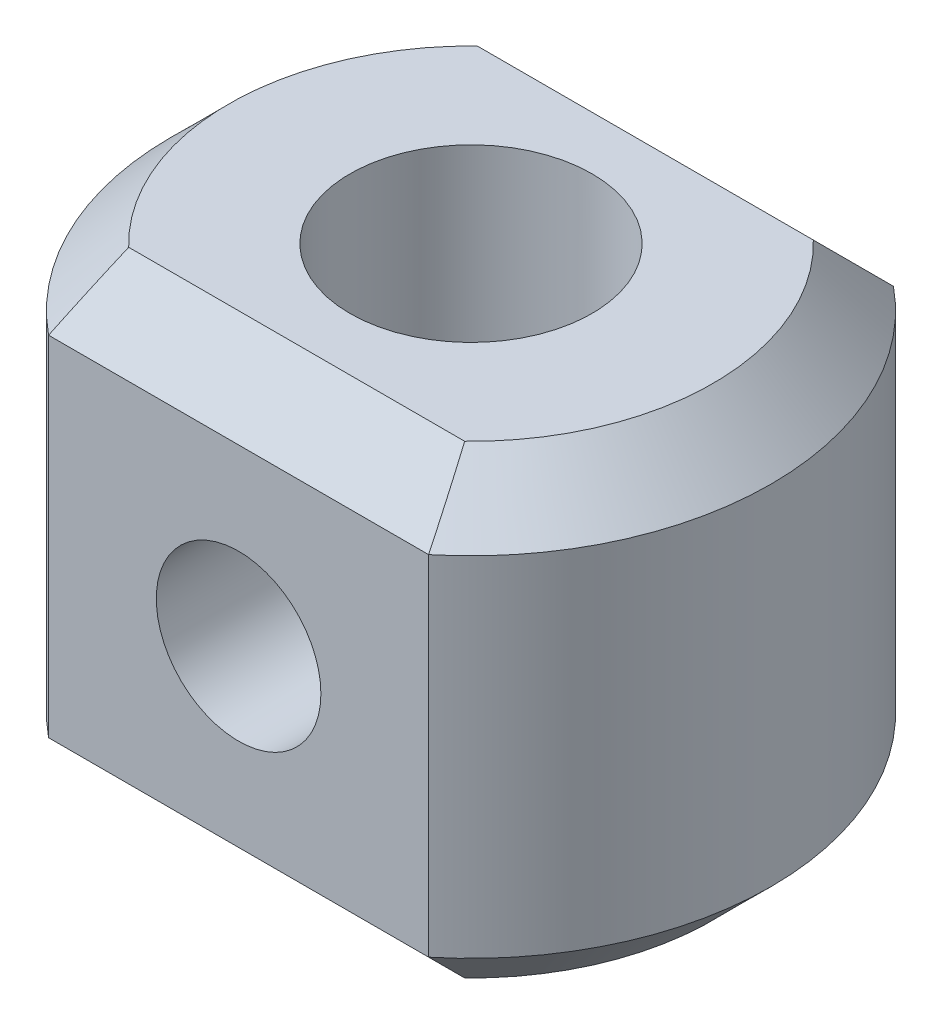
ISO-10303-21;
HEADER;
FILE_DESCRIPTION(('STEP AP214'),'2;1');
FILE_NAME('part.step','',(''),(''),'','','');
FILE_SCHEMA(('AUTOMOTIVE_DESIGN { 1 0 10303 214 1 1 1 1 }'));
ENDSEC;
DATA;
#1=APPLICATION_CONTEXT('core data for automotive mechanical design processes');
#2=APPLICATION_PROTOCOL_DEFINITION('international standard','automotive_design',2000,#1);
#3=PRODUCT_CONTEXT('',#1,'mechanical');
#4=PRODUCT('Part','Part','',(#3));
#5=PRODUCT_RELATED_PRODUCT_CATEGORY('part','',(#4));
#6=PRODUCT_DEFINITION_FORMATION('','',#4);
#7=PRODUCT_DEFINITION_CONTEXT('part definition',#1,'design');
#8=PRODUCT_DEFINITION('design','',#6,#7);
#9=PRODUCT_DEFINITION_SHAPE('','',#8);
#10=(LENGTH_UNIT() NAMED_UNIT(*) SI_UNIT(.MILLI.,.METRE.));
#11=(NAMED_UNIT(*) PLANE_ANGLE_UNIT() SI_UNIT($,.RADIAN.));
#12=(NAMED_UNIT(*) SI_UNIT($,.STERADIAN.) SOLID_ANGLE_UNIT());
#13=UNCERTAINTY_MEASURE_WITH_UNIT(LENGTH_MEASURE(1.E-05),#10,'distance_accuracy_value','');
#14=(GEOMETRIC_REPRESENTATION_CONTEXT(3) GLOBAL_UNCERTAINTY_ASSIGNED_CONTEXT((#13)) GLOBAL_UNIT_ASSIGNED_CONTEXT((#10,
#11,#12)) REPRESENTATION_CONTEXT('',''));
#15=CARTESIAN_POINT('',(0.,0.,0.));
#16=DIRECTION('',(0.,0.,1.));
#17=DIRECTION('',(1.,0.,0.));
#18=AXIS2_PLACEMENT_3D('',#15,#16,#17);
#19=CARTESIAN_POINT('',(0.,24.0000000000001,0.));
#20=DIRECTION('',(0.,1.,0.));
#21=DIRECTION('',(0.,0.,1.));
#22=AXIS2_PLACEMENT_3D('',#19,#20,#21);
#23=PLANE('',#22);
#24=CARTESIAN_POINT('',(0.,24.0000000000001,0.));
#25=DIRECTION('',(0.,1.,0.));
#26=DIRECTION('',(0.,0.,1.));
#27=AXIS2_PLACEMENT_3D('',#24,#25,#26);
#28=CIRCLE('',#27,12.5);
#29=CARTESIAN_POINT('',(0.,24.0000000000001,12.5));
#30=VERTEX_POINT('',#29);
#31=EDGE_CURVE('E438',#30,#30,#28,.T.);
#32=ORIENTED_EDGE('',*,*,#31,.F.);
#33=EDGE_LOOP('',(#32));
#34=FACE_BOUND('',#33,.T.);
#35=CARTESIAN_POINT('',(0.,24.0000000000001,0.));
#36=DIRECTION('',(0.,1.,0.));
#37=DIRECTION('',(0.,0.,1.));
#38=AXIS2_PLACEMENT_3D('',#35,#36,#37);
#39=CIRCLE('',#38,25.);
#40=CARTESIAN_POINT('',(17.3493515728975,24.0000000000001,18.));
#41=VERTEX_POINT('',#40);
#42=CARTESIAN_POINT('',(17.3493515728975,24.0000000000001,-18.));
#43=VERTEX_POINT('',#42);
#44=EDGE_CURVE('E31',#41,#43,#39,.T.);
#45=ORIENTED_EDGE('',*,*,#44,.T.);
#46=DIRECTION('',(-1.,0.,0.));
#47=VECTOR('',#46,1.);
#48=CARTESIAN_POINT('',(-19.6214168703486,24.,-18.));
#49=LINE('',#48,#47);
#50=CARTESIAN_POINT('',(-17.3493515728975,24.,-18.));
#51=VERTEX_POINT('',#50);
#52=EDGE_CURVE('E10',#43,#51,#49,.T.);
#53=ORIENTED_EDGE('',*,*,#52,.T.);
#54=CARTESIAN_POINT('',(0.,24.0000000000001,0.));
#55=DIRECTION('',(0.,1.,0.));
#56=DIRECTION('',(0.,0.,1.));
#57=AXIS2_PLACEMENT_3D('',#54,#55,#56);
#58=CIRCLE('',#57,25.);
#59=CARTESIAN_POINT('',(-17.3493515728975,24.,18.));
#60=VERTEX_POINT('',#59);
#61=EDGE_CURVE('E179',#51,#60,#58,.T.);
#62=ORIENTED_EDGE('',*,*,#61,.T.);
#63=DIRECTION('',(1.,0.,0.));
#64=VECTOR('',#63,1.);
#65=CARTESIAN_POINT('',(19.6214168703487,24.0000000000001,18.));
#66=LINE('',#65,#64);
#67=EDGE_CURVE('E49',#60,#41,#66,.T.);
#68=ORIENTED_EDGE('',*,*,#67,.T.);
#69=EDGE_LOOP('',(#45,#53,#62,#68));
#70=FACE_BOUND('',#69,.T.);
#71=ADVANCED_FACE('F16',(#34,#70),#23,.T.);
#72=CARTESIAN_POINT('',(0.,-24.,0.));
#73=DIRECTION('',(0.,1.,0.));
#74=DIRECTION('',(0.,0.,1.));
#75=AXIS2_PLACEMENT_3D('',#72,#73,#74);
#76=PLANE('',#75);
#77=CARTESIAN_POINT('',(0.,-24.,0.));
#78=DIRECTION('',(0.,1.,0.));
#79=DIRECTION('',(0.,0.,1.));
#80=AXIS2_PLACEMENT_3D('',#77,#78,#79);
#81=CIRCLE('',#80,12.5);
#82=CARTESIAN_POINT('',(0.,-24.,12.5));
#83=VERTEX_POINT('',#82);
#84=EDGE_CURVE('E431',#83,#83,#81,.T.);
#85=ORIENTED_EDGE('',*,*,#84,.T.);
#86=EDGE_LOOP('',(#85));
#87=FACE_BOUND('',#86,.T.);
#88=DIRECTION('',(-1.,0.,0.));
#89=VECTOR('',#88,1.);
#90=CARTESIAN_POINT('',(0.,-24.,18.));
#91=LINE('',#90,#89);
#92=CARTESIAN_POINT('',(17.3493515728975,-24.0000000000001,18.));
#93=VERTEX_POINT('',#92);
#94=CARTESIAN_POINT('',(-17.3493515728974,-24.,18.));
#95=VERTEX_POINT('',#94);
#96=EDGE_CURVE('E149',#93,#95,#91,.T.);
#97=ORIENTED_EDGE('',*,*,#96,.T.);
#98=CARTESIAN_POINT('',(0.,-24.,0.));
#99=DIRECTION('',(0.,1.,0.));
#100=DIRECTION('',(0.,0.,1.));
#101=AXIS2_PLACEMENT_3D('',#98,#99,#100);
#102=CIRCLE('',#101,25.);
#103=CARTESIAN_POINT('',(-17.3493515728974,-24.,-18.));
#104=VERTEX_POINT('',#103);
#105=EDGE_CURVE('E161',#95,#104,#102,.F.);
#106=ORIENTED_EDGE('',*,*,#105,.T.);
#107=DIRECTION('',(1.,0.,0.));
#108=VECTOR('',#107,1.);
#109=CARTESIAN_POINT('',(0.,-24.,-18.));
#110=LINE('',#109,#108);
#111=CARTESIAN_POINT('',(17.3493515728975,-24.0000000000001,-18.));
#112=VERTEX_POINT('',#111);
#113=EDGE_CURVE('E158',#104,#112,#110,.T.);
#114=ORIENTED_EDGE('',*,*,#113,.T.);
#115=CARTESIAN_POINT('',(0.,-24.,0.));
#116=DIRECTION('',(0.,1.,0.));
#117=DIRECTION('',(0.,0.,1.));
#118=AXIS2_PLACEMENT_3D('',#115,#116,#117);
#119=CIRCLE('',#118,25.);
#120=EDGE_CURVE('E155',#112,#93,#119,.F.);
#121=ORIENTED_EDGE('',*,*,#120,.T.);
#122=EDGE_LOOP('',(#97,#106,#114,#121));
#123=FACE_BOUND('',#122,.T.);
#124=ADVANCED_FACE('F264',(#87,#123),#76,.F.);
#125=CARTESIAN_POINT('',(0.,24.0000000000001,0.));
#126=DIRECTION('',(0.,-1.,0.));
#127=DIRECTION('',(0.,0.,-1.));
#128=AXIS2_PLACEMENT_3D('',#125,#126,#127);
#129=CYLINDRICAL_SURFACE('',#128,31.);
#130=DIRECTION('',(0.,-1.,0.));
#131=VECTOR('',#130,1.);
#132=CARTESIAN_POINT('',(-19.6214168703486,24.,-24.0000000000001));
#133=LINE('',#132,#131);
#134=CARTESIAN_POINT('',(-19.6214168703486,18.0000000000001,-24.0000000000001));
#135=VERTEX_POINT('',#134);
#136=CARTESIAN_POINT('',(-19.6214168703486,-18.,-24.0000000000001));
#137=VERTEX_POINT('',#136);
#138=EDGE_CURVE('E228',#135,#137,#133,.T.);
#139=ORIENTED_EDGE('',*,*,#138,.T.);
#140=CARTESIAN_POINT('',(0.,-18.,0.));
#141=DIRECTION('',(0.,1.,0.));
#142=DIRECTION('',(0.,0.,1.));
#143=AXIS2_PLACEMENT_3D('',#140,#141,#142);
#144=CIRCLE('',#143,31.);
#145=CARTESIAN_POINT('',(-19.6214168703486,-18.,24.0000000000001));
#146=VERTEX_POINT('',#145);
#147=EDGE_CURVE('E131',#137,#146,#144,.T.);
#148=ORIENTED_EDGE('',*,*,#147,.T.);
#149=DIRECTION('',(0.,-1.,0.));
#150=VECTOR('',#149,1.);
#151=CARTESIAN_POINT('',(-19.6214168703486,24.,24.0000000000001));
#152=LINE('',#151,#150);
#153=CARTESIAN_POINT('',(-19.6214168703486,18.0000000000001,24.0000000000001));
#154=VERTEX_POINT('',#153);
#155=EDGE_CURVE('E113',#154,#146,#152,.T.);
#156=ORIENTED_EDGE('',*,*,#155,.F.);
#157=CARTESIAN_POINT('',(0.,18.,0.));
#158=DIRECTION('',(0.,1.,0.));
#159=DIRECTION('',(0.,0.,1.));
#160=AXIS2_PLACEMENT_3D('',#157,#158,#159);
#161=CIRCLE('',#160,31.);
#162=EDGE_CURVE('E128',#154,#135,#161,.F.);
#163=ORIENTED_EDGE('',*,*,#162,.T.);
#164=EDGE_LOOP('',(#139,#148,#156,#163));
#165=FACE_BOUND('',#164,.T.);
#166=ADVANCED_FACE('F126',(#165),#129,.T.);
#167=CARTESIAN_POINT('',(-19.6214168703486,24.,24.0000000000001));
#168=DIRECTION('',(0.,0.,-1.));
#169=DIRECTION('',(-1.,0.,0.));
#170=AXIS2_PLACEMENT_3D('',#167,#168,#169);
#171=PLANE('',#170);
#172=CARTESIAN_POINT('',(0.,0.,24.0000000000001));
#173=DIRECTION('',(0.,0.,1.));
#174=DIRECTION('',(1.,0.,0.));
#175=AXIS2_PLACEMENT_3D('',#172,#173,#174);
#176=CIRCLE('',#175,8.50000000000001);
#177=CARTESIAN_POINT('',(8.50000000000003,0.,24.0000000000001));
#178=VERTEX_POINT('',#177);
#179=EDGE_CURVE('E456',#178,#178,#176,.T.);
#180=ORIENTED_EDGE('',*,*,#179,.F.);
#181=EDGE_LOOP('',(#180));
#182=FACE_BOUND('',#181,.T.);
#183=ORIENTED_EDGE('',*,*,#155,.T.);
#184=DIRECTION('',(1.,0.,0.));
#185=VECTOR('',#184,1.);
#186=CARTESIAN_POINT('',(-19.6214168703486,-18.,24.0000000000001));
#187=LINE('',#186,#185);
#188=CARTESIAN_POINT('',(19.6214168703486,-18.,24.0000000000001));
#189=VERTEX_POINT('',#188);
#190=EDGE_CURVE('E120',#146,#189,#187,.T.);
#191=ORIENTED_EDGE('',*,*,#190,.T.);
#192=DIRECTION('',(0.,-1.,0.));
#193=VECTOR('',#192,1.);
#194=CARTESIAN_POINT('',(19.6214168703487,24.0000000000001,24.0000000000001));
#195=LINE('',#194,#193);
#196=CARTESIAN_POINT('',(19.6214168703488,18.0000000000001,24.0000000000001));
#197=VERTEX_POINT('',#196);
#198=EDGE_CURVE('E115',#197,#189,#195,.T.);
#199=ORIENTED_EDGE('',*,*,#198,.F.);
#200=DIRECTION('',(-1.,0.,0.));
#201=VECTOR('',#200,1.);
#202=CARTESIAN_POINT('',(-19.6214168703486,18.0000000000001,24.0000000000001));
#203=LINE('',#202,#201);
#204=EDGE_CURVE('E110',#197,#154,#203,.T.);
#205=ORIENTED_EDGE('',*,*,#204,.T.);
#206=EDGE_LOOP('',(#183,#191,#199,#205));
#207=FACE_BOUND('',#206,.T.);
#208=ADVANCED_FACE('F112',(#182,#207),#171,.F.);
#209=CARTESIAN_POINT('',(0.,24.0000000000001,0.));
#210=DIRECTION('',(0.,-1.,0.));
#211=DIRECTION('',(0.,0.,-1.));
#212=AXIS2_PLACEMENT_3D('',#209,#210,#211);
#213=CYLINDRICAL_SURFACE('',#212,31.);
#214=ORIENTED_EDGE('',*,*,#198,.T.);
#215=CARTESIAN_POINT('',(0.,-18.,0.));
#216=DIRECTION('',(0.,1.,0.));
#217=DIRECTION('',(0.,0.,1.));
#218=AXIS2_PLACEMENT_3D('',#215,#216,#217);
#219=CIRCLE('',#218,31.);
#220=CARTESIAN_POINT('',(19.6214168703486,-18.,-24.0000000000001));
#221=VERTEX_POINT('',#220);
#222=EDGE_CURVE('E121',#189,#221,#219,.T.);
#223=ORIENTED_EDGE('',*,*,#222,.T.);
#224=DIRECTION('',(0.,-1.,0.));
#225=VECTOR('',#224,1.);
#226=CARTESIAN_POINT('',(19.6214168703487,24.0000000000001,-24.0000000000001));
#227=LINE('',#226,#225);
#228=CARTESIAN_POINT('',(19.6214168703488,18.0000000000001,-24.0000000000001));
#229=VERTEX_POINT('',#228);
#230=EDGE_CURVE('E509',#229,#221,#227,.T.);
#231=ORIENTED_EDGE('',*,*,#230,.F.);
#232=CARTESIAN_POINT('',(0.,18.,0.));
#233=DIRECTION('',(0.,1.,0.));
#234=DIRECTION('',(0.,0.,1.));
#235=AXIS2_PLACEMENT_3D('',#232,#233,#234);
#236=CIRCLE('',#235,31.);
#237=EDGE_CURVE('E172',#229,#197,#236,.F.);
#238=ORIENTED_EDGE('',*,*,#237,.T.);
#239=EDGE_LOOP('',(#214,#223,#231,#238));
#240=FACE_BOUND('',#239,.T.);
#241=ADVANCED_FACE('F281',(#240),#213,.T.);
#242=CARTESIAN_POINT('',(-19.6214168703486,24.,-24.0000000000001));
#243=DIRECTION('',(0.,0.,1.));
#244=DIRECTION('',(1.,0.,0.));
#245=AXIS2_PLACEMENT_3D('',#242,#243,#244);
#246=PLANE('',#245);
#247=CARTESIAN_POINT('',(0.,0.,-24.0000000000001));
#248=DIRECTION('',(0.,0.,1.));
#249=DIRECTION('',(1.,0.,0.));
#250=AXIS2_PLACEMENT_3D('',#247,#248,#249);
#251=CIRCLE('',#250,8.50000000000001);
#252=CARTESIAN_POINT('',(8.50000000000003,0.,-24.0000000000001));
#253=VERTEX_POINT('',#252);
#254=EDGE_CURVE('E437',#253,#253,#251,.T.);
#255=ORIENTED_EDGE('',*,*,#254,.T.);
#256=EDGE_LOOP('',(#255));
#257=FACE_BOUND('',#256,.T.);
#258=ORIENTED_EDGE('',*,*,#230,.T.);
#259=DIRECTION('',(-1.,0.,0.));
#260=VECTOR('',#259,1.);
#261=CARTESIAN_POINT('',(-19.6214168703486,-18.,-24.0000000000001));
#262=LINE('',#261,#260);
#263=EDGE_CURVE('E169',#221,#137,#262,.T.);
#264=ORIENTED_EDGE('',*,*,#263,.T.);
#265=ORIENTED_EDGE('',*,*,#138,.F.);
#266=DIRECTION('',(1.,0.,0.));
#267=VECTOR('',#266,1.);
#268=CARTESIAN_POINT('',(19.6214168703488,18.0000000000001,-24.0000000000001));
#269=LINE('',#268,#267);
#270=EDGE_CURVE('E165',#135,#229,#269,.T.);
#271=ORIENTED_EDGE('',*,*,#270,.T.);
#272=EDGE_LOOP('',(#258,#264,#265,#271));
#273=FACE_BOUND('',#272,.T.);
#274=ADVANCED_FACE('F278',(#257,#273),#246,.F.);
#275=CARTESIAN_POINT('',(0.,-18.,0.));
#276=DIRECTION('',(0.,1.,0.));
#277=DIRECTION('',(0.,0.,1.));
#278=AXIS2_PLACEMENT_3D('',#275,#276,#277);
#279=CONICAL_SURFACE('',#278,31.,0.785398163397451);
#280=CARTESIAN_POINT('',(17.3493515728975,-24.0000000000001,18.));
#281=CARTESIAN_POINT('',(17.5501842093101,-23.502203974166,18.4977960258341));
#282=CARTESIAN_POINT('',(17.7478180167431,-23.0037662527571,18.996233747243));
#283=CARTESIAN_POINT('',(18.1371787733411,-22.0057696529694,19.9942303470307));
#284=CARTESIAN_POINT('',(18.328906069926,-21.5062108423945,20.4937891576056));
#285=CARTESIAN_POINT('',(18.7069652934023,-20.5060831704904,21.4939168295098));
#286=CARTESIAN_POINT('',(18.8932973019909,-20.0055143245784,21.9944856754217));
#287=CARTESIAN_POINT('',(19.2609880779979,-19.0034323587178,22.9965676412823));
#288=CARTESIAN_POINT('',(19.4423465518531,-18.5019191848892,23.4980808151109));
#289=CARTESIAN_POINT('',(19.6214168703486,-18.,24.0000000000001));
#290=B_SPLINE_CURVE_WITH_KNOTS('',3,(#280,#281,#282,#283,#284,#285,#286,#287,#288,#289),
.UNSPECIFIED.,.F.,.F.,(4,2,2,2,4),(0.,2.19621393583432,4.39229844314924,6.58834967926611,
8.78453025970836),.UNSPECIFIED.);
#291=EDGE_CURVE('E229',#93,#189,#290,.T.);
#292=ORIENTED_EDGE('',*,*,#291,.F.);
#293=ORIENTED_EDGE('',*,*,#120,.F.);
#294=CARTESIAN_POINT('',(17.3493515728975,-24.0000000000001,-18.));
#295=CARTESIAN_POINT('',(17.5501842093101,-23.502203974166,-18.4977960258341));
#296=CARTESIAN_POINT('',(17.7478180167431,-23.0037662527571,-18.996233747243));
#297=CARTESIAN_POINT('',(18.1371787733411,-22.0057696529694,-19.9942303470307));
#298=CARTESIAN_POINT('',(18.328906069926,-21.5062108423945,-20.4937891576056));
#299=CARTESIAN_POINT('',(18.7069652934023,-20.5060831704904,-21.4939168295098));
#300=CARTESIAN_POINT('',(18.8932973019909,-20.0055143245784,-21.9944856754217));
#301=CARTESIAN_POINT('',(19.2609880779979,-19.0034323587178,-22.9965676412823));
#302=CARTESIAN_POINT('',(19.4423465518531,-18.5019191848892,-23.4980808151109));
#303=CARTESIAN_POINT('',(19.6214168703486,-18.,-24.0000000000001));
#304=B_SPLINE_CURVE_WITH_KNOTS('',3,(#294,#295,#296,#297,#298,#299,#300,#301,#302,#303),
.UNSPECIFIED.,.F.,.F.,(4,2,2,2,4),(0.,2.19621393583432,4.39229844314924,6.58834967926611,
8.78453025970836),.UNSPECIFIED.);
#305=EDGE_CURVE('E220',#221,#112,#304,.F.);
#306=ORIENTED_EDGE('',*,*,#305,.F.);
#307=ORIENTED_EDGE('',*,*,#222,.F.);
#308=EDGE_LOOP('',(#292,#293,#306,#307));
#309=FACE_BOUND('',#308,.T.);
#310=ADVANCED_FACE('F214',(#309),#279,.T.);
#311=CARTESIAN_POINT('',(-19.6214168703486,-18.,-24.0000000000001));
#312=DIRECTION('',(0.,0.707106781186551,0.707106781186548));
#313=DIRECTION('',(-1.,0.,0.));
#314=AXIS2_PLACEMENT_3D('',#311,#312,#313);
#315=PLANE('',#314);
#316=ORIENTED_EDGE('',*,*,#305,.T.);
#317=ORIENTED_EDGE('',*,*,#113,.F.);
#318=CARTESIAN_POINT('',(-17.3493515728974,-24.,-18.));
#319=CARTESIAN_POINT('',(-17.55018420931,-23.502203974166,-18.4977960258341));
#320=CARTESIAN_POINT('',(-17.7478180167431,-23.0037662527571,-18.996233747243));
#321=CARTESIAN_POINT('',(-18.1371787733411,-22.0057696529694,-19.9942303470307));
#322=CARTESIAN_POINT('',(-18.328906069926,-21.5062108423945,-20.4937891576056));
#323=CARTESIAN_POINT('',(-18.7069652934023,-20.5060831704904,-21.4939168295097));
#324=CARTESIAN_POINT('',(-18.8932973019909,-20.0055143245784,-21.9944856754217));
#325=CARTESIAN_POINT('',(-19.2609880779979,-19.0034323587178,-22.9965676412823));
#326=CARTESIAN_POINT('',(-19.4423465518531,-18.5019191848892,-23.4980808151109));
#327=CARTESIAN_POINT('',(-19.6214168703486,-18.,-24.0000000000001));
#328=B_SPLINE_CURVE_WITH_KNOTS('',3,(#318,#319,#320,#321,#322,#323,#324,#325,#326,#327),
.UNSPECIFIED.,.F.,.F.,(4,2,2,2,4),(0.,2.19621393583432,4.39229844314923,6.5883496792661,
8.78453025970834),.UNSPECIFIED.);
#329=EDGE_CURVE('E195',#137,#104,#328,.F.);
#330=ORIENTED_EDGE('',*,*,#329,.F.);
#331=ORIENTED_EDGE('',*,*,#263,.F.);
#332=EDGE_LOOP('',(#316,#317,#330,#331));
#333=FACE_BOUND('',#332,.T.);
#334=ADVANCED_FACE('F209',(#333),#315,.F.);
#335=CARTESIAN_POINT('',(-19.6214168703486,-18.,24.0000000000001));
#336=DIRECTION('',(0.,0.707106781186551,-0.707106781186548));
#337=DIRECTION('',(1.,0.,0.));
#338=AXIS2_PLACEMENT_3D('',#335,#336,#337);
#339=PLANE('',#338);
#340=ORIENTED_EDGE('',*,*,#291,.T.);
#341=ORIENTED_EDGE('',*,*,#190,.F.);
#342=CARTESIAN_POINT('',(-19.6214168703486,-18.,24.0000000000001));
#343=CARTESIAN_POINT('',(-19.4423465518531,-18.5019191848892,23.4980808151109));
#344=CARTESIAN_POINT('',(-19.2609880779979,-19.0034323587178,22.9965676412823));
#345=CARTESIAN_POINT('',(-18.8932973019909,-20.0055143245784,21.9944856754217));
#346=CARTESIAN_POINT('',(-18.7069652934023,-20.5060831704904,21.4939168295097));
#347=CARTESIAN_POINT('',(-18.328906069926,-21.5062108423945,20.4937891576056));
#348=CARTESIAN_POINT('',(-18.1371787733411,-22.0057696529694,19.9942303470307));
#349=CARTESIAN_POINT('',(-17.7478180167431,-23.0037662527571,18.996233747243));
#350=CARTESIAN_POINT('',(-17.55018420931,-23.502203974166,18.4977960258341));
#351=CARTESIAN_POINT('',(-17.3493515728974,-24.0000000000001,18.));
#352=B_SPLINE_CURVE_WITH_KNOTS('',3,(#342,#343,#344,#345,#346,#347,#348,#349,#350,#351),
.UNSPECIFIED.,.F.,.F.,(4,2,2,2,4),(0.,2.19618058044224,4.3922318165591,6.58831632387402,
8.78453025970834),.UNSPECIFIED.);
#353=EDGE_CURVE('E186',#95,#146,#352,.F.);
#354=ORIENTED_EDGE('',*,*,#353,.F.);
#355=ORIENTED_EDGE('',*,*,#96,.F.);
#356=EDGE_LOOP('',(#340,#341,#354,#355));
#357=FACE_BOUND('',#356,.T.);
#358=ADVANCED_FACE('F202',(#357),#339,.F.);
#359=CARTESIAN_POINT('',(0.,-18.,0.));
#360=DIRECTION('',(0.,1.,0.));
#361=DIRECTION('',(0.,0.,1.));
#362=AXIS2_PLACEMENT_3D('',#359,#360,#361);
#363=CONICAL_SURFACE('',#362,31.,0.785398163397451);
#364=ORIENTED_EDGE('',*,*,#329,.T.);
#365=ORIENTED_EDGE('',*,*,#105,.F.);
#366=ORIENTED_EDGE('',*,*,#353,.T.);
#367=ORIENTED_EDGE('',*,*,#147,.F.);
#368=EDGE_LOOP('',(#364,#365,#366,#367));
#369=FACE_BOUND('',#368,.T.);
#370=ADVANCED_FACE('F205',(#369),#363,.T.);
#371=CARTESIAN_POINT('',(0.,24.0000000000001,18.));
#372=DIRECTION('',(0.,0.707106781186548,0.707106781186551));
#373=DIRECTION('',(-1.,0.,0.));
#374=AXIS2_PLACEMENT_3D('',#371,#372,#373);
#375=PLANE('',#374);
#376=CARTESIAN_POINT('',(-19.6214168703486,18.0000000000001,24.0000000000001));
#377=CARTESIAN_POINT('',(-19.4423465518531,18.5019191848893,23.4980808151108));
#378=CARTESIAN_POINT('',(-19.2609880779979,19.0034323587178,22.9965676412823));
#379=CARTESIAN_POINT('',(-18.893297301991,20.0055143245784,21.9944856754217));
#380=CARTESIAN_POINT('',(-18.7069652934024,20.5060831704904,21.4939168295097));
#381=CARTESIAN_POINT('',(-18.3289060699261,21.5062108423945,20.4937891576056));
#382=CARTESIAN_POINT('',(-18.1371787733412,22.0057696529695,19.9942303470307));
#383=CARTESIAN_POINT('',(-17.7478180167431,23.0037662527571,18.996233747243));
#384=CARTESIAN_POINT('',(-17.5501842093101,23.502203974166,18.4977960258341));
#385=CARTESIAN_POINT('',(-17.3493515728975,24.,18.0000000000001));
#386=B_SPLINE_CURVE_WITH_KNOTS('',3,(#376,#377,#378,#379,#380,#381,#382,#383,#384,#385),
.UNSPECIFIED.,.F.,.F.,(4,2,2,2,4),(0.,2.19618058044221,4.39223181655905,6.58831632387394,
8.78453025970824),.UNSPECIFIED.);
#387=EDGE_CURVE('E135',#154,#60,#386,.T.);
#388=ORIENTED_EDGE('',*,*,#387,.F.);
#389=ORIENTED_EDGE('',*,*,#204,.F.);
#390=CARTESIAN_POINT('',(19.6214168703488,18.0000000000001,24.0000000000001));
#391=CARTESIAN_POINT('',(19.4423465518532,18.5019191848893,23.4980808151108));
#392=CARTESIAN_POINT('',(19.2609880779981,19.0034323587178,22.9965676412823));
#393=CARTESIAN_POINT('',(18.8932973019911,20.0055143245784,21.9944856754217));
#394=CARTESIAN_POINT('',(18.7069652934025,20.5060831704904,21.4939168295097));
#395=CARTESIAN_POINT('',(18.3289060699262,21.5062108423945,20.4937891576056));
#396=CARTESIAN_POINT('',(18.1371787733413,22.0057696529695,19.9942303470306));
#397=CARTESIAN_POINT('',(17.7478180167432,23.0037662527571,18.996233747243));
#398=CARTESIAN_POINT('',(17.5501842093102,23.502203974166,18.4977960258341));
#399=CARTESIAN_POINT('',(17.3493515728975,24.0000000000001,18.0000000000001));
#400=B_SPLINE_CURVE_WITH_KNOTS('',3,(#390,#391,#392,#393,#394,#395,#396,#397,#398,#399),
.UNSPECIFIED.,.F.,.F.,(4,2,2,2,4),(0.,2.19618058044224,4.3922318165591,6.58831632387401,
8.78453025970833),.UNSPECIFIED.);
#401=EDGE_CURVE('E21',#41,#197,#400,.F.);
#402=ORIENTED_EDGE('',*,*,#401,.F.);
#403=ORIENTED_EDGE('',*,*,#67,.F.);
#404=EDGE_LOOP('',(#388,#389,#402,#403));
#405=FACE_BOUND('',#404,.T.);
#406=ADVANCED_FACE('F18',(#405),#375,.T.);
#407=CARTESIAN_POINT('',(0.,24.0000000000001,0.));
#408=DIRECTION('',(0.,-1.,0.));
#409=DIRECTION('',(0.,0.,-1.));
#410=AXIS2_PLACEMENT_3D('',#407,#408,#409);
#411=CONICAL_SURFACE('',#410,25.,0.785398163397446);
#412=ORIENTED_EDGE('',*,*,#401,.T.);
#413=ORIENTED_EDGE('',*,*,#237,.F.);
#414=CARTESIAN_POINT('',(19.6214168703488,18.0000000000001,-24.0000000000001));
#415=CARTESIAN_POINT('',(19.4423465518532,18.5019191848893,-23.4980808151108));
#416=CARTESIAN_POINT('',(19.2609880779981,19.0034323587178,-22.9965676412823));
#417=CARTESIAN_POINT('',(18.8932973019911,20.0055143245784,-21.9944856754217));
#418=CARTESIAN_POINT('',(18.7069652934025,20.5060831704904,-21.4939168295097));
#419=CARTESIAN_POINT('',(18.3289060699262,21.5062108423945,-20.4937891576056));
#420=CARTESIAN_POINT('',(18.1371787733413,22.0057696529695,-19.9942303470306));
#421=CARTESIAN_POINT('',(17.7478180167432,23.0037662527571,-18.996233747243));
#422=CARTESIAN_POINT('',(17.5501842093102,23.502203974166,-18.4977960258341));
#423=CARTESIAN_POINT('',(17.3493515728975,24.0000000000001,-18.0000000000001));
#424=B_SPLINE_CURVE_WITH_KNOTS('',3,(#414,#415,#416,#417,#418,#419,#420,#421,#422,#423),
.UNSPECIFIED.,.F.,.F.,(4,2,2,2,4),(0.,2.19618058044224,4.3922318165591,6.58831632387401,
8.78453025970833),.UNSPECIFIED.);
#425=EDGE_CURVE('E139',#43,#229,#424,.F.);
#426=ORIENTED_EDGE('',*,*,#425,.F.);
#427=ORIENTED_EDGE('',*,*,#44,.F.);
#428=EDGE_LOOP('',(#412,#413,#426,#427));
#429=FACE_BOUND('',#428,.T.);
#430=ADVANCED_FACE('F252',(#429),#411,.T.);
#431=CARTESIAN_POINT('',(0.,24.0000000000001,0.));
#432=DIRECTION('',(0.,-1.,0.));
#433=DIRECTION('',(0.,0.,-1.));
#434=AXIS2_PLACEMENT_3D('',#431,#432,#433);
#435=CONICAL_SURFACE('',#434,25.,0.785398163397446);
#436=ORIENTED_EDGE('',*,*,#387,.T.);
#437=ORIENTED_EDGE('',*,*,#61,.F.);
#438=CARTESIAN_POINT('',(-17.3493515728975,24.,-18.));
#439=CARTESIAN_POINT('',(-17.5501842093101,23.502203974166,-18.4977960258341));
#440=CARTESIAN_POINT('',(-17.7478180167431,23.0037662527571,-18.996233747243));
#441=CARTESIAN_POINT('',(-18.1371787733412,22.0057696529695,-19.9942303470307));
#442=CARTESIAN_POINT('',(-18.3289060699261,21.5062108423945,-20.4937891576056));
#443=CARTESIAN_POINT('',(-18.7069652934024,20.5060831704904,-21.4939168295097));
#444=CARTESIAN_POINT('',(-18.893297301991,20.0055143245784,-21.9944856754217));
#445=CARTESIAN_POINT('',(-19.2609880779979,19.0034323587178,-22.9965676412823));
#446=CARTESIAN_POINT('',(-19.4423465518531,18.5019191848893,-23.4980808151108));
#447=CARTESIAN_POINT('',(-19.6214168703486,18.0000000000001,-24.0000000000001));
#448=B_SPLINE_CURVE_WITH_KNOTS('',3,(#438,#439,#440,#441,#442,#443,#444,#445,#446,#447),
.UNSPECIFIED.,.F.,.F.,(4,2,2,2,4),(0.,2.19621393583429,4.39229844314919,6.58834967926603,
8.78453025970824),.UNSPECIFIED.);
#449=EDGE_CURVE('E142',#135,#51,#448,.F.);
#450=ORIENTED_EDGE('',*,*,#449,.F.);
#451=ORIENTED_EDGE('',*,*,#162,.F.);
#452=EDGE_LOOP('',(#436,#437,#450,#451));
#453=FACE_BOUND('',#452,.T.);
#454=ADVANCED_FACE('F141',(#453),#435,.T.);
#455=CARTESIAN_POINT('',(0.,24.0000000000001,-18.));
#456=DIRECTION('',(0.,0.707106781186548,-0.707106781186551));
#457=DIRECTION('',(1.,0.,0.));
#458=AXIS2_PLACEMENT_3D('',#455,#456,#457);
#459=PLANE('',#458);
#460=ORIENTED_EDGE('',*,*,#425,.T.);
#461=ORIENTED_EDGE('',*,*,#270,.F.);
#462=ORIENTED_EDGE('',*,*,#449,.T.);
#463=ORIENTED_EDGE('',*,*,#52,.F.);
#464=EDGE_LOOP('',(#460,#461,#462,#463));
#465=FACE_BOUND('',#464,.T.);
#466=ADVANCED_FACE('F247',(#465),#459,.T.);
#467=CARTESIAN_POINT('',(0.,0.,-24.0000000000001));
#468=DIRECTION('',(0.,0.,1.));
#469=DIRECTION('',(1.,0.,0.));
#470=AXIS2_PLACEMENT_3D('',#467,#468,#469);
#471=CYLINDRICAL_SURFACE('',#470,8.50000000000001);
#472=CARTESIAN_POINT('',(8.50000000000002,0.,9.1651513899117));
#473=CARTESIAN_POINT('',(8.49999848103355,-0.206088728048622,9.16515435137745));
#474=CARTESIAN_POINT('',(8.49248800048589,-0.412212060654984,9.17213583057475));
#475=CARTESIAN_POINT('',(8.4626153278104,-0.822482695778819,9.19970325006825));
#476=CARTESIAN_POINT('',(8.44024911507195,-1.02662944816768,9.22029287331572));
#477=CARTESIAN_POINT('',(8.38110344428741,-1.43143853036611,9.27408730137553));
#478=CARTESIAN_POINT('',(8.34430186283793,-1.63209501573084,9.30731146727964));
#479=CARTESIAN_POINT('',(8.25695470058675,-2.0282711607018,9.38488691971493));
#480=CARTESIAN_POINT('',(8.20640187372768,-2.22378805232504,9.42924407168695));
#481=CARTESIAN_POINT('',(8.09292937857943,-2.6065126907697,9.52680514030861));
#482=CARTESIAN_POINT('',(8.03014703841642,-2.79378671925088,9.57990988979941));
#483=CARTESIAN_POINT('',(7.89263199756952,-3.16147211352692,9.69352020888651));
#484=CARTESIAN_POINT('',(7.81790087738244,-3.34188438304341,9.75402479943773));
#485=CARTESIAN_POINT('',(7.57668843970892,-3.87228632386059,9.94412008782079));
#486=CARTESIAN_POINT('',(7.39312795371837,-4.21164033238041,10.0823463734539));
#487=CARTESIAN_POINT('',(7.07025089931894,-4.72346898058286,10.3093525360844));
#488=CARTESIAN_POINT('',(6.94452130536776,-4.90639680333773,10.3946444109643));
#489=CARTESIAN_POINT('',(6.67951741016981,-5.26147264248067,10.5668815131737));
#490=CARTESIAN_POINT('',(6.54024093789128,-5.43361892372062,10.6538270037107));
#491=CARTESIAN_POINT('',(6.24847211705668,-5.76677475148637,10.8275327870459));
#492=CARTESIAN_POINT('',(6.09596586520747,-5.92777225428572,10.9142927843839));
#493=CARTESIAN_POINT('',(5.7782479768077,-6.23787798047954,11.0857764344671));
#494=CARTESIAN_POINT('',(5.61303651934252,-6.38698637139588,11.1705001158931));
#495=CARTESIAN_POINT('',(5.24396777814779,-6.69455134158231,11.3489649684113));
#496=CARTESIAN_POINT('',(5.03807127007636,-6.85092906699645,11.4420938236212));
#497=CARTESIAN_POINT('',(4.61060952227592,-7.14560475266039,11.6209276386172));
#498=CARTESIAN_POINT('',(4.38904162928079,-7.28389964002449,11.7066313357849));
#499=CARTESIAN_POINT('',(3.93167037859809,-7.54059872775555,11.8680532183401));
#500=CARTESIAN_POINT('',(3.69588915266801,-7.65903281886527,11.9437863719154));
#501=CARTESIAN_POINT('',(3.21133572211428,-7.8744872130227,12.0830786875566));
#502=CARTESIAN_POINT('',(2.96256879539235,-7.97151613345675,12.1466427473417));
#503=CARTESIAN_POINT('',(2.51940835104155,-8.12048949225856,12.2450026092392));
#504=CARTESIAN_POINT('',(2.32744758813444,-8.17761353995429,12.2829947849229));
#505=CARTESIAN_POINT('',(1.93855933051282,-8.27842440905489,12.3503400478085));
#506=CARTESIAN_POINT('',(1.74163284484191,-8.32211393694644,12.3796948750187));
#507=CARTESIAN_POINT('',(1.34415899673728,-8.39547825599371,12.4291319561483));
#508=CARTESIAN_POINT('',(1.14361390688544,-8.42516154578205,12.4492198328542));
#509=CARTESIAN_POINT('',(0.740172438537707,-8.47014398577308,12.4797061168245));
#510=CARTESIAN_POINT('',(0.537275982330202,-8.4854426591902,12.4901042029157));
#511=CARTESIAN_POINT('',(0.130292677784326,-8.50144499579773,12.5009812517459));
#512=CARTESIAN_POINT('',(-0.0737956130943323,-8.50212364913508,12.5014432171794));
#513=CARTESIAN_POINT('',(-0.481268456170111,-8.48881228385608,12.4923941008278));
#514=CARTESIAN_POINT('',(-0.684653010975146,-8.47482231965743,12.4828830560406));
#515=CARTESIAN_POINT('',(-1.08925251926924,-8.43237316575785,12.4541027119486));
#516=CARTESIAN_POINT('',(-1.29046693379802,-8.40391046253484,12.4348310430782));
#517=CARTESIAN_POINT('',(-1.68926040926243,-8.33291196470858,12.3869582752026));
#518=CARTESIAN_POINT('',(-1.88683945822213,-8.29037612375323,12.3583571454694));
#519=CARTESIAN_POINT('',(-2.27341125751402,-8.19271606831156,12.2930591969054));
#520=CARTESIAN_POINT('',(-2.46249567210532,-8.13784446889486,12.2565252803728));
#521=CARTESIAN_POINT('',(-2.83498515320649,-8.01569065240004,12.1757627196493));
#522=CARTESIAN_POINT('',(-3.01838819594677,-7.94840407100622,12.1315313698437));
#523=CARTESIAN_POINT('',(-3.37855314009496,-7.80212422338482,12.0361979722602));
#524=CARTESIAN_POINT('',(-3.55531685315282,-7.72313418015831,11.9850978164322));
#525=CARTESIAN_POINT('',(-3.90160552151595,-7.55411389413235,11.8768867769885));
#526=CARTESIAN_POINT('',(-4.07112783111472,-7.46407966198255,11.8197737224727));
#527=CARTESIAN_POINT('',(-4.60515263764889,-7.15702515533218,11.6273640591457));
#528=CARTESIAN_POINT('',(-4.95443467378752,-6.91941946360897,11.4819087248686));
#529=CARTESIAN_POINT('',(-5.61048966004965,-6.39907800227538,11.1760341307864));
#530=CARTESIAN_POINT('',(-5.91721289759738,-6.11629027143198,11.0155977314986));
#531=CARTESIAN_POINT('',(-6.36728205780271,-5.63619465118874,10.7584574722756));
#532=CARTESIAN_POINT('',(-6.52562305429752,-5.45208481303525,10.6629213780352));
#533=CARTESIAN_POINT('',(-6.82630605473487,-5.0705569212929,10.4729720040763));
#534=CARTESIAN_POINT('',(-6.96864485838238,-4.87313621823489,10.3785589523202));
#535=CARTESIAN_POINT('',(-7.23654495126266,-4.46563149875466,10.1935722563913));
#536=CARTESIAN_POINT('',(-7.36211199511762,-4.25555186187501,10.1029973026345));
#537=CARTESIAN_POINT('',(-7.59563797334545,-3.82316808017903,9.92862060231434));
#538=CARTESIAN_POINT('',(-7.70360245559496,-3.60086781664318,9.84481672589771));
#539=CARTESIAN_POINT('',(-7.87744955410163,-3.1987114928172,9.70593012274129));
#540=CARTESIAN_POINT('',(-7.94724371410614,-3.02126590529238,9.64874475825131));
#541=CARTESIAN_POINT('',(-8.07530611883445,-2.66009809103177,9.54182315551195));
#542=CARTESIAN_POINT('',(-8.13357730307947,-2.47637747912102,9.49208501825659));
#543=CARTESIAN_POINT('',(-8.23787325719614,-2.10353590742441,9.40171308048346));
#544=CARTESIAN_POINT('',(-8.28391305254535,-1.91442189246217,9.36106811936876));
#545=CARTESIAN_POINT('',(-8.36314474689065,-1.53165800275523,9.2903518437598));
#546=CARTESIAN_POINT('',(-8.39634341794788,-1.33801057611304,9.2602749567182));
#547=CARTESIAN_POINT('',(-8.44956721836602,-0.945692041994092,9.2117388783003));
#548=CARTESIAN_POINT('',(-8.46947419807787,-0.746991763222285,9.19338394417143));
#549=CARTESIAN_POINT('',(-8.49523044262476,-0.347903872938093,9.1695895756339));
#550=CARTESIAN_POINT('',(-8.50107999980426,-0.147516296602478,9.16414987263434));
#551=CARTESIAN_POINT('',(-8.49859215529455,0.253093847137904,9.16645695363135));
#552=CARTESIAN_POINT('',(-8.49025465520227,0.453316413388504,9.17420382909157));
#553=CARTESIAN_POINT('',(-8.45957672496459,0.851756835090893,9.20249925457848));
#554=CARTESIAN_POINT('',(-8.43723660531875,1.04997473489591,9.22304752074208));
#555=CARTESIAN_POINT('',(-8.38234977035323,1.4202539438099,9.27293958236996));
#556=CARTESIAN_POINT('',(-8.35126652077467,1.59270907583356,9.30100519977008));
#557=CARTESIAN_POINT('',(-8.27891598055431,1.93390828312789,9.36546286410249));
#558=CARTESIAN_POINT('',(-8.23764498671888,2.10265098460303,9.40185793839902));
#559=CARTESIAN_POINT('',(-8.09920438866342,2.60235745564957,9.52196552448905));
#560=CARTESIAN_POINT('',(-7.98740749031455,2.92679747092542,9.61660009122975));
#561=CARTESIAN_POINT('',(-7.76406944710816,3.46846651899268,9.79713340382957));
#562=CARTESIAN_POINT('',(-7.66076855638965,3.69080928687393,9.87837957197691));
#563=CARTESIAN_POINT('',(-7.4366803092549,4.12373086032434,10.0481614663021));
#564=CARTESIAN_POINT('',(-7.31588641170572,4.33430522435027,10.1366999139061));
#565=CARTESIAN_POINT('',(-7.057555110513,4.74336953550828,10.3182305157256));
#566=CARTESIAN_POINT('',(-6.91999133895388,4.94183969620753,10.4112295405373));
#567=CARTESIAN_POINT('',(-6.62896506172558,5.32586600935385,10.5989056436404));
#568=CARTESIAN_POINT('',(-6.47550429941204,5.51142357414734,10.6935825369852));
#569=CARTESIAN_POINT('',(-6.15090881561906,5.871620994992,10.8835743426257));
#570=CARTESIAN_POINT('',(-5.97955300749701,6.04606711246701,10.9788790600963));
#571=CARTESIAN_POINT('',(-5.62152225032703,6.38031823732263,11.1664376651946));
#572=CARTESIAN_POINT('',(-5.43484617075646,6.54012216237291,11.2586913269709));
#573=CARTESIAN_POINT('',(-5.04701734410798,6.8438435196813,11.4377960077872));
#574=CARTESIAN_POINT('',(-4.84588487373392,6.98778251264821,11.5246542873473));
#575=CARTESIAN_POINT('',(-4.4296632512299,7.2587681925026,11.690948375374));
#576=CARTESIAN_POINT('',(-4.21457708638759,7.38581847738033,11.7703857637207));
#577=CARTESIAN_POINT('',(-3.81036768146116,7.6009156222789,11.9066482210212));
#578=CARTESIAN_POINT('',(-3.62331315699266,7.69189434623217,11.9649950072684));
#579=CARTESIAN_POINT('',(-3.24118379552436,7.86055502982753,12.0741123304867));
#580=CARTESIAN_POINT('',(-3.04611042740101,7.93823941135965,12.1248842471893));
#581=CARTESIAN_POINT('',(-2.64898456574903,8.0794349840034,12.2177921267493));
#582=CARTESIAN_POINT('',(-2.44693506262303,8.14295216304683,12.2599317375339));
#583=CARTESIAN_POINT('',(-2.03698952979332,8.255048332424,12.3346697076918));
#584=CARTESIAN_POINT('',(-1.82909342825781,8.30362713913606,12.3672679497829));
#585=CARTESIAN_POINT('',(-1.40786635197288,8.38535402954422,12.4222881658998));
#586=CARTESIAN_POINT('',(-1.19451359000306,8.41842464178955,12.444659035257));
#587=CARTESIAN_POINT('',(-0.765042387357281,8.46826065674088,12.4784254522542));
#588=CARTESIAN_POINT('',(-0.548923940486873,8.48502602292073,12.4898209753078));
#589=CARTESIAN_POINT('',(-0.115773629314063,8.50197421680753,12.5013410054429));
#590=CARTESIAN_POINT('',(0.101258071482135,8.50215989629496,12.5014674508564));
#591=CARTESIAN_POINT('',(0.534404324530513,8.48595163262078,12.4904499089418));
#592=CARTESIAN_POINT('',(0.750518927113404,8.4695586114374,12.4793065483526));
#593=CARTESIAN_POINT('',(1.16241743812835,8.42248049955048,12.447405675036));
#594=CARTESIAN_POINT('',(1.35841686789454,8.39307583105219,12.4275102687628));
#595=CARTESIAN_POINT('',(1.74688971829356,8.32090248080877,12.3788814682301));
#596=CARTESIAN_POINT('',(1.93936192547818,8.27812928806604,12.3501450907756));
#597=CARTESIAN_POINT('',(2.31949660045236,8.17976012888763,12.2844266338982));
#598=CARTESIAN_POINT('',(2.50716024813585,8.12416734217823,12.2474465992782));
#599=CARTESIAN_POINT('',(2.87680266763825,8.00074950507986,12.1659297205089));
#600=CARTESIAN_POINT('',(3.05877922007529,7.93291974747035,12.1213899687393));
#601=CARTESIAN_POINT('',(3.42502338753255,7.78205387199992,12.0231826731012));
#602=CARTESIAN_POINT('',(3.60895648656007,7.69843014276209,11.9691718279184));
#603=CARTESIAN_POINT('',(3.96887157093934,7.51920837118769,11.8546927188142));
#604=CARTESIAN_POINT('',(4.1448506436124,7.42360598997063,11.7942221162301));
#605=CARTESIAN_POINT('',(4.48818758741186,7.22121052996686,11.6678888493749));
#606=CARTESIAN_POINT('',(4.65554628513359,7.11441852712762,11.6020267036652));
#607=CARTESIAN_POINT('',(4.98122598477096,6.89031710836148,11.465973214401));
#608=CARTESIAN_POINT('',(5.13954593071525,6.77300646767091,11.3957813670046));
#609=CARTESIAN_POINT('',(5.47100763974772,6.50920384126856,11.2408452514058));
#610=CARTESIAN_POINT('',(5.64255328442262,6.36102654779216,11.1555508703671));
#611=CARTESIAN_POINT('',(5.97261424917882,6.05218750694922,10.9823777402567));
#612=CARTESIAN_POINT('',(6.13112820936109,5.89152446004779,10.8944987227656));
#613=CARTESIAN_POINT('',(6.43506912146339,5.55795958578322,10.7177821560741));
#614=CARTESIAN_POINT('',(6.58046470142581,5.3850300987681,10.6289428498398));
#615=CARTESIAN_POINT('',(6.8572641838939,5.0278197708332,10.4525049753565));
#616=CARTESIAN_POINT('',(6.98867228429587,4.84354236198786,10.3649060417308));
#617=CARTESIAN_POINT('',(7.25348598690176,4.43879738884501,10.1816587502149));
#618=CARTESIAN_POINT('',(7.38484786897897,4.21677037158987,10.086482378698));
#619=CARTESIAN_POINT('',(7.62800421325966,3.75908521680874,9.90387210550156));
#620=CARTESIAN_POINT('',(7.73979297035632,3.52342313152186,9.81644046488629));
#621=CARTESIAN_POINT('',(7.94202112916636,3.04016642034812,9.65355456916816));
#622=CARTESIAN_POINT('',(8.03253732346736,2.79261872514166,9.57805756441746));
#623=CARTESIAN_POINT('',(8.19100322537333,2.28642961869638,9.44289751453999));
#624=CARTESIAN_POINT('',(8.25897325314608,2.02779843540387,9.38322022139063));
#625=CARTESIAN_POINT('',(8.37565430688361,1.4778693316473,9.27928856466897));
#626=CARTESIAN_POINT('',(8.42210570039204,1.18571576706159,9.23688551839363));
#627=CARTESIAN_POINT('',(8.46874460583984,0.743269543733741,9.19406014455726));
#628=CARTESIAN_POINT('',(8.48045122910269,0.595069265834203,9.18324817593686));
#629=CARTESIAN_POINT('',(8.49607882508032,0.297918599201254,9.16879332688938));
#630=CARTESIAN_POINT('',(8.50000109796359,0.148968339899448,9.16514924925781));
#631=CARTESIAN_POINT('',(8.50000000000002,0.,9.1651513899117));
#632=B_SPLINE_CURVE_WITH_KNOTS('',3,(#472,#473,#474,#475,#476,#477,#478,#479,#480,#481,#482,
#483,#484,#485,#486,#487,#488,#489,#490,#491,#492,#493,#494,#495,#496,#497,#498,#499,#500,#501,
#502,#503,#504,#505,#506,#507,#508,#509,#510,#511,#512,#513,#514,#515,#516,#517,#518,#519,#520,
#521,#522,#523,#524,#525,#526,#527,#528,#529,#530,#531,#532,#533,#534,#535,#536,#537,#538,#539,
#540,#541,#542,#543,#544,#545,#546,#547,#548,#549,#550,#551,#552,#553,#554,#555,#556,#557,#558,
#559,#560,#561,#562,#563,#564,#565,#566,#567,#568,#569,#570,#571,#572,#573,#574,#575,#576,#577,
#578,#579,#580,#581,#582,#583,#584,#585,#586,#587,#588,#589,#590,#591,#592,#593,#594,#595,#596,
#597,#598,#599,#600,#601,#602,#603,#604,#605,#606,#607,#608,#609,#610,#611,#612,#613,#614,#615,
#616,#617,#618,#619,#620,#621,#622,#623,#624,#625,#626,#627,#628,#629,#630,#631),.UNSPECIFIED.,
.T.,.F.,(4,2,2,2,2,2,2,2,2,2,2,2,2,2,2,2,2,2,2,2,2,2,2,2,2,2,2,2,2,2,2,2,2,2,2,2,2,2,2,2,2,2,2,
2,2,2,2,2,2,2,2,2,2,2,2,2,2,2,2,2,2,2,2,2,2,2,2,2,2,2,2,2,2,2,2,2,2,2,2,4),(0.,
0.618076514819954,1.23632037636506,1.85551547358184,2.47503748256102,3.08796676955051,
3.70081504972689,4.92587263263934,5.63876070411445,6.35176321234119,7.06552431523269,
7.77927535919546,8.60259642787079,9.42605722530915,10.2482673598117,11.0701458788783,
11.6810712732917,12.2918735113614,12.9023046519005,13.5127560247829,14.1242515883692,
14.7357448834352,15.3473867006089,15.9590305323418,16.559135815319,17.1594524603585,
17.7596040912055,18.3599731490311,19.6949262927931,21.0314258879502,21.813555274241,
22.5958408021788,23.377857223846,24.1596266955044,24.7563236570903,25.3528682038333,
25.9486765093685,26.5441701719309,27.1448890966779,27.7455955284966,28.346306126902,
28.9470034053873,29.4788453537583,30.010880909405,31.074958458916,31.8489288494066,
32.6231894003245,33.3986834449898,34.1740925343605,34.9605742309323,35.7471140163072,
36.5325713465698,37.3178610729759,37.9653245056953,38.6126698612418,39.2597410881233,
39.9068202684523,40.5570983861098,41.2073779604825,41.8575456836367,42.5076772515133,
43.1045651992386,43.7016547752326,44.298596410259,44.8957681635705,45.5225771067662,
46.1496137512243,46.7765901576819,47.4036396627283,48.129507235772,48.8554504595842,
49.5830861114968,50.3105027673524,51.1343321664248,51.9584012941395,52.7794482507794,
53.5997531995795,54.4932533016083,54.9400958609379,55.3868637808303),.UNSPECIFIED.);
#633=CARTESIAN_POINT('',(8.50000000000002,0.,9.1651513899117));
#634=VERTEX_POINT('',#633);
#635=EDGE_CURVE('E241',#634,#634,#632,.T.);
#636=ORIENTED_EDGE('',*,*,#635,.T.);
#637=EDGE_LOOP('',(#636));
#638=FACE_BOUND('',#637,.T.);
#639=ORIENTED_EDGE('',*,*,#179,.T.);
#640=EDGE_LOOP('',(#639));
#641=FACE_BOUND('',#640,.T.);
#642=ADVANCED_FACE('F250',(#638,#641),#471,.F.);
#643=CARTESIAN_POINT('',(0.,8.5000000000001,-12.5000000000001));
#644=CARTESIAN_POINT('',(-0.212611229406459,8.49999916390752,-12.4999992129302));
#645=CARTESIAN_POINT('',(-0.425235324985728,8.49201135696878,-12.4945635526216));
#646=CARTESIAN_POINT('',(-0.848748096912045,8.46018514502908,-12.472954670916));
#647=CARTESIAN_POINT('',(-1.05963663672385,8.43634550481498,-12.4567806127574));
#648=CARTESIAN_POINT('',(-1.47813144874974,8.37316767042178,-12.4140805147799));
#649=CARTESIAN_POINT('',(-1.68573577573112,8.33382062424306,-12.3875485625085));
#650=CARTESIAN_POINT('',(-2.09603319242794,8.24020192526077,-12.3247605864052));
#651=CARTESIAN_POINT('',(-2.29872630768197,8.18593035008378,-12.2885046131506));
#652=CARTESIAN_POINT('',(-2.69687782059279,8.06349857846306,-12.2072897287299));
#653=CARTESIAN_POINT('',(-2.89236813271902,7.99541143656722,-12.1623766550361));
#654=CARTESIAN_POINT('',(-3.2762264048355,7.84594082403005,-12.0646421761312));
#655=CARTESIAN_POINT('',(-3.46459154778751,7.7645521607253,-12.0118176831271));
#656=CARTESIAN_POINT('',(-3.83321341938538,7.58934124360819,-11.8993103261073));
#657=CARTESIAN_POINT('',(-4.01347330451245,7.49552388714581,-11.8396301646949));
#658=CARTESIAN_POINT('',(-4.36534472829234,7.29621057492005,-11.7144651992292));
#659=CARTESIAN_POINT('',(-4.53695302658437,7.1907102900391,-11.6489782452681));
#660=CARTESIAN_POINT('',(-5.0666723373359,6.83873972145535,-11.4338002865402));
#661=CARTESIAN_POINT('',(-5.40791044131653,6.57183587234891,-11.275289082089));
#662=CARTESIAN_POINT('',(-6.04383553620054,5.99230020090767,-10.9476160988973));
#663=CARTESIAN_POINT('',(-6.3384531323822,5.67960152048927,-10.7784389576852));
#664=CARTESIAN_POINT('',(-6.76524031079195,5.15207751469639,-10.5126540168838));
#665=CARTESIAN_POINT('',(-6.91391766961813,4.95081833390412,-10.4152047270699));
#666=CARTESIAN_POINT('',(-7.19372836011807,4.53466127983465,-10.2239406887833));
#667=CARTESIAN_POINT('',(-7.32485747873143,4.31976014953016,-10.1301268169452));
#668=CARTESIAN_POINT('',(-7.56837784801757,3.87728453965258,-9.94950319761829));
#669=CARTESIAN_POINT('',(-7.68079896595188,3.64973104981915,-9.86268240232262));
#670=CARTESIAN_POINT('',(-7.88596866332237,3.18223393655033,-9.69941732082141));
#671=CARTESIAN_POINT('',(-7.9787168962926,2.94229009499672,-9.62297321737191));
#672=CARTESIAN_POINT('',(-8.11849832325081,2.52448279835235,-9.50503456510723));
#673=CARTESIAN_POINT('',(-8.17091788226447,2.34942992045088,-9.45991392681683));
#674=CARTESIAN_POINT('',(-8.26470838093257,1.99455320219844,-9.37808462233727));
#675=CARTESIAN_POINT('',(-8.30608643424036,1.81473251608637,-9.34137054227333));
#676=CARTESIAN_POINT('',(-8.37721986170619,1.45134940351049,-9.27763294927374));
#677=CARTESIAN_POINT('',(-8.40699037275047,1.26779218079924,-9.25059681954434));
#678=CARTESIAN_POINT('',(-8.45450274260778,0.897860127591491,-9.20719421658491));
#679=CARTESIAN_POINT('',(-8.47224456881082,0.711485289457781,-9.19082777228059));
#680=CARTESIAN_POINT('',(-8.49542774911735,0.336415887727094,-9.16940360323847));
#681=CARTESIAN_POINT('',(-8.50080981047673,0.147714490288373,-9.1644003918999));
#682=CARTESIAN_POINT('',(-8.49899309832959,-0.229574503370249,-9.16608517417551));
#683=CARTESIAN_POINT('',(-8.49179431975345,-0.418162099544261,-9.17277317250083));
#684=CARTESIAN_POINT('',(-8.46494901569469,-0.793801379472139,-9.197552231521));
#685=CARTESIAN_POINT('',(-8.44529473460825,-0.980852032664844,-9.21565039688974));
#686=CARTESIAN_POINT('',(-8.39389136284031,-1.35191704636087,-9.2624937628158));
#687=CARTESIAN_POINT('',(-8.36214199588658,-1.53593133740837,-9.29123920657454));
#688=CARTESIAN_POINT('',(-8.28904286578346,-1.89016540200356,-9.35649660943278));
#689=CARTESIAN_POINT('',(-8.24828955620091,-2.06060006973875,-9.39251749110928));
#690=CARTESIAN_POINT('',(-8.15687607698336,-2.39703838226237,-9.47201379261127));
#691=CARTESIAN_POINT('',(-8.10621222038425,-2.56304035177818,-9.51549198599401));
#692=CARTESIAN_POINT('',(-7.94004717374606,-3.05365736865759,-9.65539110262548));
#693=CARTESIAN_POINT('',(-7.81036608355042,-3.37091404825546,-9.76128254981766));
#694=CARTESIAN_POINT('',(-7.5543637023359,-3.90455677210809,-9.95995741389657));
#695=CARTESIAN_POINT('',(-7.4356172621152,-4.12603609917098,-10.0491983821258));
#696=CARTESIAN_POINT('',(-7.18015660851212,-4.55608081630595,-10.2332855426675));
#697=CARTESIAN_POINT('',(-7.0434357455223,-4.7646413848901,-10.3281338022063));
#698=CARTESIAN_POINT('',(-6.75265789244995,-5.16852530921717,-10.5205544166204));
#699=CARTESIAN_POINT('',(-6.59857255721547,-5.36382616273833,-10.6181310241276));
#700=CARTESIAN_POINT('',(-6.27388868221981,-5.74021551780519,-10.8131484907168));
#701=CARTESIAN_POINT('',(-6.10329207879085,-5.92130568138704,-10.9105893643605));
#702=CARTESIAN_POINT('',(-5.744544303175,-6.27003459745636,-11.1036963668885));
#703=CARTESIAN_POINT('',(-5.55625225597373,-6.4375414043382,-11.199339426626));
#704=CARTESIAN_POINT('',(-5.1639635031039,-6.75628192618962,-11.385544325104));
#705=CARTESIAN_POINT('',(-4.95996542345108,-6.90751421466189,-11.4761057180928));
#706=CARTESIAN_POINT('',(-4.53740472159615,-7.19212977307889,-11.6496366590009));
#707=CARTESIAN_POINT('',(-4.31886875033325,-7.32554442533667,-11.7326194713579));
#708=CARTESIAN_POINT('',(-3.86797195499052,-7.57330248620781,-11.8888885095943));
#709=CARTESIAN_POINT('',(-3.63561531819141,-7.68765163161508,-11.9621776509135));
#710=CARTESIAN_POINT('',(-3.21144130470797,-7.87259042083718,-12.0819654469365));
#711=CARTESIAN_POINT('',(-3.022053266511,-7.94726158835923,-12.1308016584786));
#712=CARTESIAN_POINT('',(-2.6367008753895,-8.08328742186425,-12.2203482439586));
#713=CARTESIAN_POINT('',(-2.44073782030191,-8.14464469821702,-12.2610602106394));
#714=CARTESIAN_POINT('',(-2.04341856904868,-8.25329241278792,-12.3334989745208));
#715=CARTESIAN_POINT('',(-1.84206499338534,-8.30058955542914,-12.3652300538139));
#716=CARTESIAN_POINT('',(-1.43518188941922,-8.38052709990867,-12.4190321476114));
#717=CARTESIAN_POINT('',(-1.22965226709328,-8.41316717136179,-12.4411029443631));
#718=CARTESIAN_POINT('',(-0.815207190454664,-8.46340091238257,-12.4751277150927));
#719=CARTESIAN_POINT('',(-0.606282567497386,-8.48094279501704,-12.4870468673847));
#720=CARTESIAN_POINT('',(-0.187370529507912,-8.50052106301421,-12.5003522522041));
#721=CARTESIAN_POINT('',(0.0226168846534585,-8.50255746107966,-12.5017384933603));
#722=CARTESIAN_POINT('',(0.441977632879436,-8.49109288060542,-12.4939441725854));
#723=CARTESIAN_POINT('',(0.651350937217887,-8.47759116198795,-12.4847631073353));
#724=CARTESIAN_POINT('',(1.06781626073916,-8.43525792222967,-12.4560561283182));
#725=CARTESIAN_POINT('',(1.27490833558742,-8.40642677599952,-12.4365304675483));
#726=CARTESIAN_POINT('',(1.67428781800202,-8.3358062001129,-12.3889073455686));
#727=CARTESIAN_POINT('',(1.86677484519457,-8.29479186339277,-12.3613238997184));
#728=CARTESIAN_POINT('',(2.24721772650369,-8.1999062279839,-12.2978542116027));
#729=CARTESIAN_POINT('',(2.43517201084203,-8.14603054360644,-12.2619651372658));
#730=CARTESIAN_POINT('',(2.80541670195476,-8.02605126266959,-12.1825890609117));
#731=CARTESIAN_POINT('',(2.9877086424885,-7.95995101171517,-12.1391041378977));
#732=CARTESIAN_POINT('',(3.34590416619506,-7.81614954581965,-12.0452988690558));
#733=CARTESIAN_POINT('',(3.52180537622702,-7.73844407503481,-11.9949760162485));
#734=CARTESIAN_POINT('',(3.8803120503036,-7.56544076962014,-11.8840705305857));
#735=CARTESIAN_POINT('',(4.0623242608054,-7.46923194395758,-11.822988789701));
#736=CARTESIAN_POINT('',(4.41740035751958,-7.26488731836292,-11.6949675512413));
#737=CARTESIAN_POINT('',(4.59046042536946,-7.15674648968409,-11.6280255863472));
#738=CARTESIAN_POINT('',(5.09553911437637,-6.81546087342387,-11.4200600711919));
#739=CARTESIAN_POINT('',(5.41350998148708,-6.5654267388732,-11.2718797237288));
#740=CARTESIAN_POINT('',(5.8844763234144,-6.13824246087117,-11.0300157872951));
#741=CARTESIAN_POINT('',(6.05109822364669,-5.97401067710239,-10.9392888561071));
#742=CARTESIAN_POINT('',(6.36999669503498,-5.63272878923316,-10.7567107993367));
#743=CARTESIAN_POINT('',(6.52227604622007,-5.45568118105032,-10.664859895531));
#744=CARTESIAN_POINT('',(6.81208921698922,-5.08920872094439,-10.4821186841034));
#745=CARTESIAN_POINT('',(6.94961342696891,-4.89977593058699,-10.3912290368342));
#746=CARTESIAN_POINT('',(7.20917257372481,-4.50919739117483,-10.212867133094));
#747=CARTESIAN_POINT('',(7.33120999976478,-4.30805353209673,-10.1253943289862));
#748=CARTESIAN_POINT('',(7.64131171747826,-3.74504307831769,-9.89544194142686));
#749=CARTESIAN_POINT('',(7.81365560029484,-3.37172386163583,-9.75870050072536));
#750=CARTESIAN_POINT('',(8.03185839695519,-2.78965723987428,-9.57852897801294));
#751=CARTESIAN_POINT('',(8.09785246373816,-2.59205087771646,-9.52264880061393));
#752=CARTESIAN_POINT('',(8.21569108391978,-2.19002993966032,-9.4211706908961));
#753=CARTESIAN_POINT('',(8.26753853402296,-1.98561676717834,-9.37557065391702));
#754=CARTESIAN_POINT('',(8.34891457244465,-1.6053011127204,-9.30312255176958));
#755=CARTESIAN_POINT('',(8.38071060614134,-1.43023273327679,-9.27442445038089));
#756=CARTESIAN_POINT('',(8.43335759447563,-1.07717839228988,-9.22657851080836));
#757=CARTESIAN_POINT('',(8.4542107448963,-0.899193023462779,-9.20742875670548));
#758=CARTESIAN_POINT('',(8.48462590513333,-0.541575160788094,-9.17940927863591));
#759=CARTESIAN_POINT('',(8.49419587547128,-0.361943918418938,-9.17053230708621));
#760=CARTESIAN_POINT('',(8.50190326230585,-0.00221826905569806,-9.16338746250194));
#761=CARTESIAN_POINT('',(8.50004044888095,0.177876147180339,-9.16511980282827));
#762=CARTESIAN_POINT('',(8.48491973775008,0.537055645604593,-9.17911982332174));
#763=CARTESIAN_POINT('',(8.47166896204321,0.716141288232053,-9.1913809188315));
#764=CARTESIAN_POINT('',(8.43401190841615,1.07214121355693,-9.22594663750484));
#765=CARTESIAN_POINT('',(8.40960570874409,1.24905551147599,-9.24825119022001));
#766=CARTESIAN_POINT('',(8.349990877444,1.59979027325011,-9.30211059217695));
#767=CARTESIAN_POINT('',(8.31477174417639,1.77360755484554,-9.33367443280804));
#768=CARTESIAN_POINT('',(8.23399688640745,2.11718373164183,-9.40500900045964));
#769=CARTESIAN_POINT('',(8.188435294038,2.28694026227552,-9.44478438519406));
#770=CARTESIAN_POINT('',(8.07133858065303,2.67520382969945,-9.54521836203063));
#771=CARTESIAN_POINT('',(7.99615670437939,2.89194177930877,-9.6084876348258));
#772=CARTESIAN_POINT('',(7.82977778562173,3.31610119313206,-9.74454307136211));
#773=CARTESIAN_POINT('',(7.73857476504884,3.52351914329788,-9.8173327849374));
#774=CARTESIAN_POINT('',(7.54100901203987,3.92861609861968,-9.96989338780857));
#775=CARTESIAN_POINT('',(7.43462915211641,4.12628375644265,-10.0496721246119));
#776=CARTESIAN_POINT('',(7.20756400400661,4.51120312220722,-10.2137476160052));
#777=CARTESIAN_POINT('',(7.08687969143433,4.69845553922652,-10.2980440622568));
#778=CARTESIAN_POINT('',(6.82924274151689,5.06584454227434,-10.4707196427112));
#779=CARTESIAN_POINT('',(6.69201335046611,5.24576434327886,-10.5591466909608));
#780=CARTESIAN_POINT('',(6.40372122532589,5.5940574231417,-10.7364335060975));
#781=CARTESIAN_POINT('',(6.25265324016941,5.76242627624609,-10.8252934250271));
#782=CARTESIAN_POINT('',(5.93711876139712,6.08702343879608,-11.0015125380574));
#783=CARTESIAN_POINT('',(5.77265023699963,6.24324990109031,-11.0888715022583));
#784=CARTESIAN_POINT('',(5.43075906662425,6.54282142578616,-11.2602586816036));
#785=CARTESIAN_POINT('',(5.25333683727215,6.68616690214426,-11.3442870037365));
#786=CARTESIAN_POINT('',(4.86280344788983,6.97635617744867,-11.5175664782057));
#787=CARTESIAN_POINT('',(4.6480139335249,7.12135889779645,-11.6061386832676));
#788=CARTESIAN_POINT('',(4.20346535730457,7.39247293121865,-11.7744368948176));
#789=CARTESIAN_POINT('',(3.97370392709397,7.51858124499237,-11.854161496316));
#790=CARTESIAN_POINT('',(3.50095025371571,7.74999907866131,-12.0022746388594));
#791=CARTESIAN_POINT('',(3.25798165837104,7.85534430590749,-12.0706826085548));
#792=CARTESIAN_POINT('',(2.76031494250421,8.04371560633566,-12.1941088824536));
#793=CARTESIAN_POINT('',(2.50562230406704,8.12675198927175,-12.249133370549));
#794=CARTESIAN_POINT('',(2.0653495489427,8.24739792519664,-12.329567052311));
#795=CARTESIAN_POINT('',(1.88214205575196,8.29115225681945,-12.3589009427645));
#796=CARTESIAN_POINT('',(1.51217598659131,8.36653680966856,-12.4095993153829));
#797=CARTESIAN_POINT('',(1.3254180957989,8.39816934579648,-12.4309653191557));
#798=CARTESIAN_POINT('',(0.949520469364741,8.4489269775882,-12.4653126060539));
#799=CARTESIAN_POINT('',(0.760381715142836,8.46805706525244,-12.4782972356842));
#800=CARTESIAN_POINT('',(0.380832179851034,8.49359470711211,-12.495641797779));
#801=CARTESIAN_POINT('',(0.190421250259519,8.50000074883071,-12.5000007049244));
#802=CARTESIAN_POINT('',(0.,8.5000000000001,-12.5000000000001));
#803=B_SPLINE_CURVE_WITH_KNOTS('',3,(#643,#644,#645,#646,#647,#648,#649,#650,#651,#652,#653,
#654,#655,#656,#657,#658,#659,#660,#661,#662,#663,#664,#665,#666,#667,#668,#669,#670,#671,#672,
#673,#674,#675,#676,#677,#678,#679,#680,#681,#682,#683,#684,#685,#686,#687,#688,#689,#690,#691,
#692,#693,#694,#695,#696,#697,#698,#699,#700,#701,#702,#703,#704,#705,#706,#707,#708,#709,#710,
#711,#712,#713,#714,#715,#716,#717,#718,#719,#720,#721,#722,#723,#724,#725,#726,#727,#728,#729,
#730,#731,#732,#733,#734,#735,#736,#737,#738,#739,#740,#741,#742,#743,#744,#745,#746,#747,#748,
#749,#750,#751,#752,#753,#754,#755,#756,#757,#758,#759,#760,#761,#762,#763,#764,#765,#766,#767,
#768,#769,#770,#771,#772,#773,#774,#775,#776,#777,#778,#779,#780,#781,#782,#783,#784,#785,#786,
#787,#788,#789,#790,#791,#792,#793,#794,#795,#796,#797,#798,#799,#800,#801,#802),.UNSPECIFIED.,
.T.,.F.,(4,2,2,2,2,2,2,2,2,2,2,2,2,2,2,2,2,2,2,2,2,2,2,2,2,2,2,2,2,2,2,2,2,2,2,2,2,2,2,2,2,2,2,
2,2,2,2,2,2,2,2,2,2,2,2,2,2,2,2,2,2,2,2,2,2,2,2,2,2,2,2,2,2,2,2,2,2,2,2,4),(0.,
0.637638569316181,1.27532683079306,1.91337962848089,2.5514291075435,3.18618871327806,
3.82119671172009,4.45595523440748,5.09094975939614,6.46937914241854,7.84984140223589,
8.65461300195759,9.45957746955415,10.2632442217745,11.0669251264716,11.6310837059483,
12.1948779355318,12.7579344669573,13.320992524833,13.8867461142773,14.4524999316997,
15.0186063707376,15.58472574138,16.1209085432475,16.6572911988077,17.7299620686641,
18.529117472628,19.3285693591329,20.1293456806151,20.9300282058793,21.7377350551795,
22.5455126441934,23.3518481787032,24.1579406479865,24.7853694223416,25.4126750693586,
26.0396811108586,26.6667012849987,27.2958636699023,27.9250255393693,28.5542173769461,
29.1833938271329,29.7789366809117,30.374682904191,30.9702663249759,31.5660686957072,
32.2096414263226,32.853486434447,34.1409914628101,34.8931975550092,35.6452575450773,
36.3978043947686,37.1502301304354,38.4443718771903,39.0908409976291,39.7371776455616,
40.2773148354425,40.8173436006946,41.356991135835,41.8966495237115,42.4359706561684,
42.9752880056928,43.5151308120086,44.0552806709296,44.7681537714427,45.4812934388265,
46.1952443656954,46.9091466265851,47.6373057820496,48.3657423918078,49.0942895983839,
49.8228133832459,50.6432675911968,51.4638519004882,52.2830124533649,53.1017937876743,
53.6731523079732,54.2444016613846,54.8154227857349,55.3865117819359),.UNSPECIFIED.);
#804=CARTESIAN_POINT('',(0.,8.5000000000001,-12.5000000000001));
#805=VERTEX_POINT('',#804);
#806=EDGE_CURVE('E448',#805,#805,#803,.T.);
#807=ORIENTED_EDGE('',*,*,#806,.T.);
#808=EDGE_LOOP('',(#807));
#809=FACE_BOUND('',#808,.T.);
#810=ORIENTED_EDGE('',*,*,#254,.F.);
#811=EDGE_LOOP('',(#810));
#812=FACE_BOUND('',#811,.T.);
#813=ADVANCED_FACE('F274',(#809,#812),#471,.F.);
#814=CARTESIAN_POINT('',(0.,24.0000000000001,0.));
#815=DIRECTION('',(0.,-1.,0.));
#816=DIRECTION('',(0.,0.,-1.));
#817=AXIS2_PLACEMENT_3D('',#814,#815,#816);
#818=CYLINDRICAL_SURFACE('',#817,12.5);
#819=ORIENTED_EDGE('',*,*,#806,.F.);
#820=EDGE_LOOP('',(#819));
#821=FACE_BOUND('',#820,.T.);
#822=ORIENTED_EDGE('',*,*,#635,.F.);
#823=EDGE_LOOP('',(#822));
#824=FACE_BOUND('',#823,.T.);
#825=ORIENTED_EDGE('',*,*,#31,.T.);
#826=EDGE_LOOP('',(#825));
#827=FACE_BOUND('',#826,.T.);
#828=ORIENTED_EDGE('',*,*,#84,.F.);
#829=EDGE_LOOP('',(#828));
#830=FACE_BOUND('',#829,.T.);
#831=ADVANCED_FACE('F394',(#821,#824,#827,#830),#818,.F.);
#832=CLOSED_SHELL('',(#71,#124,#166,#208,#241,#274,#310,#334,#358,#370,#406,#430,#454,#466,#642,
#813,#831));
#833=MANIFOLD_SOLID_BREP('B1',#832);
#834=ADVANCED_BREP_SHAPE_REPRESENTATION('',(#18,#833),#14);
#835=SHAPE_DEFINITION_REPRESENTATION(#9,#834);
ENDSEC;
END-ISO-10303-21;
